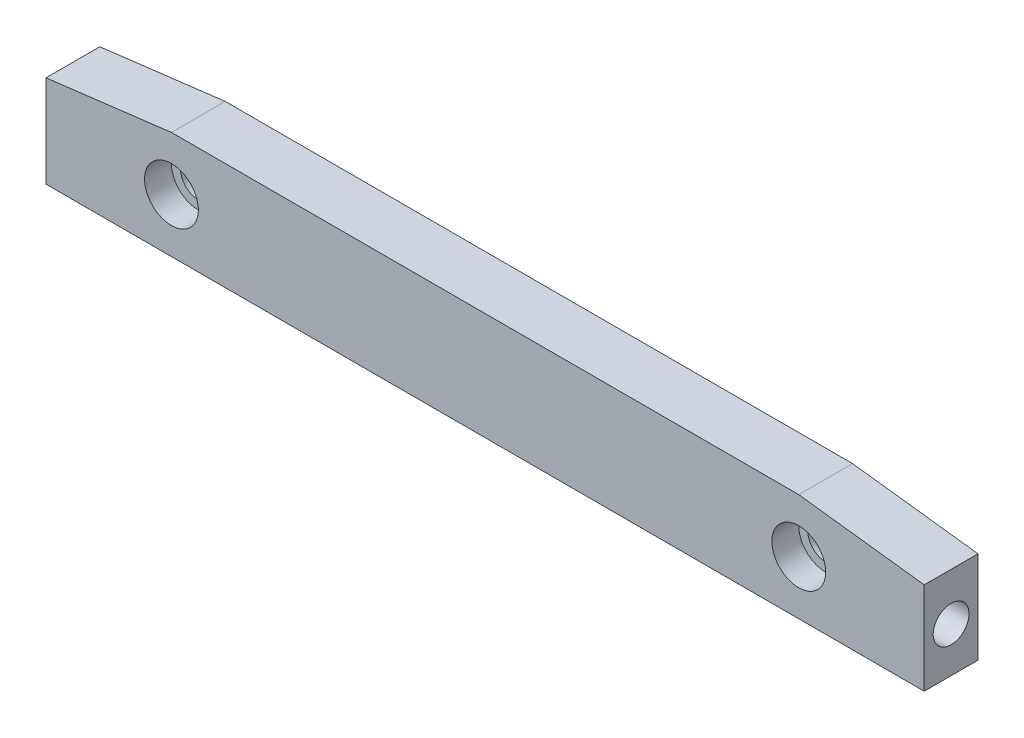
from build123d import *

# Parameters (mm, degrees)
SKETCH2_R                       = 3.175
BOSS_EXTRUDE1_DEPTH             = 4.7625
SKETCH3_R                       = 4.7625
CUT_EXTRUDE1_DEPTH              = 9.525
F_1_4_0_25_DIAMETER_HOLE1_D     = 6.35
F_1_4_0_25_DIAMETER_HOLE1_DEPTH = 15.24
F_1_4_0_25_DIAMETER_HOLE1_TIP   = 1.907732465
F_1_4_0_25_DIAMETER_HOLE2_D     = 6.35
F_1_4_0_25_DIAMETER_HOLE2_DEPTH = 15.24
F_1_4_0_25_DIAMETER_HOLE2_TIP   = 1.907732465
CHAMFER1_SIZE                   = 22.225
CHAMFER1_SIZE2                  = 2.728886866
CHAMFER2_SIZE                   = 22.225
CHAMFER2_SIZE2                  = 2.728886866


with BuildPart() as part:
    # Sketch2 → Boss-Extrude1 (new, symmetric)
    with BuildSketch(Plane.XY):
        Polygon((-77.7875, 0), (0, 0), (77.7875, 0), (77.7875, 19.05), (-77.7875, 19.05), align=None)
        with Locations(Location((-55.5625, 9.525, 0), (0, 0, 180))):
            Circle(SKETCH2_R, mode=Mode.SUBTRACT)
        with Locations(Location((55.5625, 9.525, 0), (0, 0, 180))):
            Circle(SKETCH2_R, mode=Mode.SUBTRACT)
    extrude(amount=BOSS_EXTRUDE1_DEPTH, both=True)

    # Sketch3 → Cut-Extrude1 (cut)
    with BuildSketch(Plane.XY):
        with Locations(Location((-55.5625, 9.525, 0), (0, 0, 180))):
            Circle(SKETCH3_R)
        with Locations(Location((55.5625, 9.525, 0), (0, 0, 180))):
            Circle(SKETCH3_R)
    extrude(amount=CUT_EXTRUDE1_DEPTH, mode=Mode.SUBTRACT)

    # 1_4 _0.25_ Diameter Hole1
    with Locations(Plane.ZY.offset(77.7875)):
        with Locations((0, 7.9248)):
            Hole(F_1_4_0_25_DIAMETER_HOLE1_D / 2, depth=F_1_4_0_25_DIAMETER_HOLE1_DEPTH)
            with Locations((0, 0, -(F_1_4_0_25_DIAMETER_HOLE1_DEPTH + F_1_4_0_25_DIAMETER_HOLE1_TIP / 2))):  # 118° drill point
                Cone(0, F_1_4_0_25_DIAMETER_HOLE1_D / 2, F_1_4_0_25_DIAMETER_HOLE1_TIP, mode=Mode.SUBTRACT)

    # 1_4 _0.25_ Diameter Hole2
    with Locations(Plane(origin=(77.7875, 0, 0), x_dir=(0, 0, -1), z_dir=(1, 0, 0))):
        with Locations((0, 7.9248)):
            Hole(F_1_4_0_25_DIAMETER_HOLE2_D / 2, depth=F_1_4_0_25_DIAMETER_HOLE2_DEPTH)
            with Locations((0, 0, -(F_1_4_0_25_DIAMETER_HOLE2_DEPTH + F_1_4_0_25_DIAMETER_HOLE2_TIP / 2))):  # 118° drill point
                Cone(0, F_1_4_0_25_DIAMETER_HOLE2_D / 2, F_1_4_0_25_DIAMETER_HOLE2_TIP, mode=Mode.SUBTRACT)

    # Chamfer1
    chamfer1_edges = [part.edges().sort_by_distance(p)[0] for p in [
        (-77.7875, 19.05, 0),
    ]]
    chamfer1_side = [part.faces().sort_by_distance(p)[0] for p in [
        (0, 19.05, 0),
    ]]
    chamfer(chamfer1_edges, length=CHAMFER1_SIZE, length2=CHAMFER1_SIZE2, reference=chamfer1_side[0])

    # Chamfer2
    chamfer2_edges = [part.edges().sort_by_distance(p)[0] for p in [
        (77.7875, 19.05, 0),
    ]]
    chamfer2_side = [part.faces().sort_by_distance(p)[0] for p in [
        (11.1125, 19.05, 0),
    ]]
    chamfer(chamfer2_edges, length=CHAMFER2_SIZE, length2=CHAMFER2_SIZE2, reference=chamfer2_side[0])


solid = part.part
